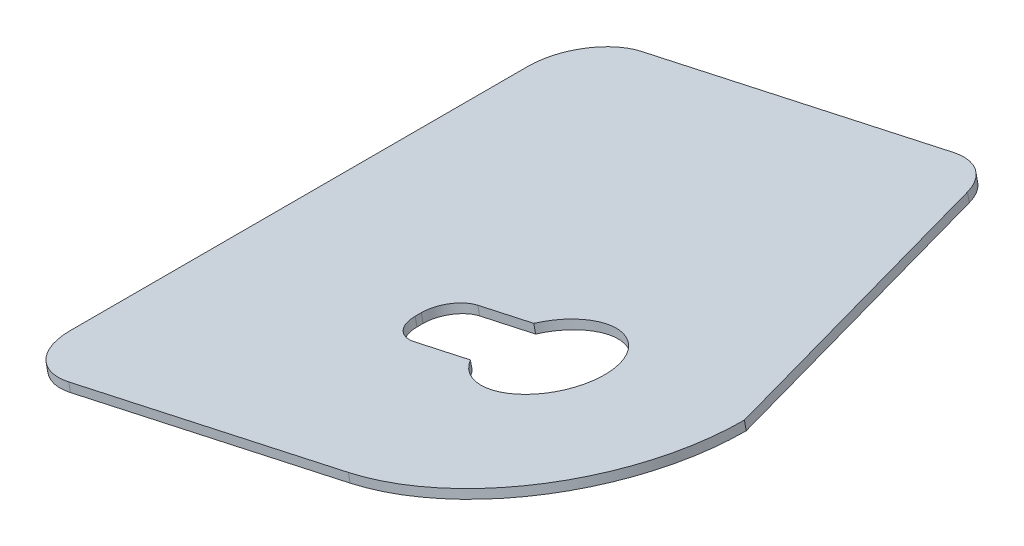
ISO-10303-21;
HEADER;
FILE_DESCRIPTION(('STEP AP214'),'2;1');
FILE_NAME('part.step','',(''),(''),'','','');
FILE_SCHEMA(('AUTOMOTIVE_DESIGN { 1 0 10303 214 1 1 1 1 }'));
ENDSEC;
DATA;
#1=APPLICATION_CONTEXT('core data for automotive mechanical design processes');
#2=APPLICATION_PROTOCOL_DEFINITION('international standard','automotive_design',2000,#1);
#3=PRODUCT_CONTEXT('',#1,'mechanical');
#4=PRODUCT('Part','Part','',(#3));
#5=PRODUCT_RELATED_PRODUCT_CATEGORY('part','',(#4));
#6=PRODUCT_DEFINITION_FORMATION('','',#4);
#7=PRODUCT_DEFINITION_CONTEXT('part definition',#1,'design');
#8=PRODUCT_DEFINITION('design','',#6,#7);
#9=PRODUCT_DEFINITION_SHAPE('','',#8);
#10=(LENGTH_UNIT() NAMED_UNIT(*) SI_UNIT(.MILLI.,.METRE.));
#11=(NAMED_UNIT(*) PLANE_ANGLE_UNIT() SI_UNIT($,.RADIAN.));
#12=(NAMED_UNIT(*) SI_UNIT($,.STERADIAN.) SOLID_ANGLE_UNIT());
#13=UNCERTAINTY_MEASURE_WITH_UNIT(LENGTH_MEASURE(1.E-05),#10,'distance_accuracy_value','');
#14=(GEOMETRIC_REPRESENTATION_CONTEXT(3) GLOBAL_UNCERTAINTY_ASSIGNED_CONTEXT((#13)) GLOBAL_UNIT_ASSIGNED_CONTEXT((#10,
#11,#12)) REPRESENTATION_CONTEXT('',''));
#15=CARTESIAN_POINT('',(0.,0.,0.));
#16=DIRECTION('',(0.,0.,1.));
#17=DIRECTION('',(1.,0.,0.));
#18=AXIS2_PLACEMENT_3D('',#15,#16,#17);
#19=CARTESIAN_POINT('',(-15.18533166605,-0.6930586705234,68.5));
#20=DIRECTION('',(0.214527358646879,-0.976717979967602,0.));
#21=DIRECTION('',(0.976717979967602,0.214527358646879,0.));
#22=AXIS2_PLACEMENT_3D('',#19,#20,#21);
#23=PLANE('',#22);
#24=DIRECTION('',(-0.976717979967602,-0.214527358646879,0.));
#25=VECTOR('',#24,1.);
#26=CARTESIAN_POINT('',(-10.3603448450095,0.3667064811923,74.6467013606));
#27=LINE('',#26,#25);
#28=CARTESIAN_POINT('',(-10.9297547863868,0.241640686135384,74.6467013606));
#29=VERTEX_POINT('',#28);
#30=CARTESIAN_POINT('',(-9.95303680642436,0.456168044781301,74.6467013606));
#31=VERTEX_POINT('',#30);
#32=EDGE_CURVE('E122',#29,#31,#27,.F.);
#33=ORIENTED_EDGE('',*,*,#32,.F.);
#34=CARTESIAN_POINT('',(-10.9297547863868,0.241640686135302,75.1467013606));
#35=DIRECTION('',(-0.214527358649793,0.976717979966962,0.));
#36=DIRECTION('',(-0.976717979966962,-0.214527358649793,0.));
#37=AXIS2_PLACEMENT_3D('',#34,#35,#36);
#38=CIRCLE('',#37,0.5);
#39=CARTESIAN_POINT('',(-11.4181137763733,0.134377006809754,75.1467013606));
#40=VERTEX_POINT('',#39);
#41=EDGE_CURVE('E23',#40,#29,#38,.F.);
#42=ORIENTED_EDGE('',*,*,#41,.F.);
#43=DIRECTION('',(0.,0.,1.));
#44=VECTOR('',#43,1.);
#45=CARTESIAN_POINT('',(-11.4181137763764,0.134377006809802,75.2));
#46=LINE('',#45,#44);
#47=CARTESIAN_POINT('',(-11.4181137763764,0.134377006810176,75.2532986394));
#48=VERTEX_POINT('',#47);
#49=EDGE_CURVE('E119',#40,#48,#46,.T.);
#50=ORIENTED_EDGE('',*,*,#49,.T.);
#51=CARTESIAN_POINT('',(-10.9297547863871,0.241640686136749,75.2532986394));
#52=DIRECTION('',(-0.214527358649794,0.976717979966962,0.));
#53=DIRECTION('',(-0.976717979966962,-0.214527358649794,0.));
#54=AXIS2_PLACEMENT_3D('',#51,#52,#53);
#55=CIRCLE('',#54,0.500000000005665);
#56=CARTESIAN_POINT('',(-10.9297547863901,0.241640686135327,75.7532986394));
#57=VERTEX_POINT('',#56);
#58=EDGE_CURVE('E154',#48,#57,#55,.T.);
#59=ORIENTED_EDGE('',*,*,#58,.T.);
#60=DIRECTION('',(0.976717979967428,0.21452735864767,0.));
#61=VECTOR('',#60,1.);
#62=CARTESIAN_POINT('',(-10.4413957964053,0.348904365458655,75.7532986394));
#63=LINE('',#62,#61);
#64=CARTESIAN_POINT('',(-9.95303680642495,0.456168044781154,75.7532986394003));
#65=VERTEX_POINT('',#64);
#66=EDGE_CURVE('E150',#57,#65,#63,.T.);
#67=ORIENTED_EDGE('',*,*,#66,.T.);
#68=CARTESIAN_POINT('',(-9.13944737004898,0.634865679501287,75.2));
#69=DIRECTION('',(0.214527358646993,-0.976717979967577,0.));
#70=DIRECTION('',(0.976717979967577,0.214527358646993,0.));
#71=AXIS2_PLACEMENT_3D('',#68,#69,#70);
#72=CIRCLE('',#71,0.999999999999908);
#73=EDGE_CURVE('E146',#65,#31,#72,.F.);
#74=ORIENTED_EDGE('',*,*,#73,.T.);
#75=EDGE_LOOP('',(#33,#42,#50,#59,#67,#74));
#76=FACE_BOUND('',#75,.T.);
#77=CARTESIAN_POINT('',(-8.57027854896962,0.759878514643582,69.7));
#78=DIRECTION('',(-0.214527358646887,0.976717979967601,0.));
#79=DIRECTION('',(-0.9767179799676,-0.214527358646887,0.));
#80=AXIS2_PLACEMENT_3D('',#77,#78,#79);
#81=CIRCLE('',#80,1.00000000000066);
#82=CARTESIAN_POINT('',(-8.57027854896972,0.759878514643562,68.6999999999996));
#83=VERTEX_POINT('',#82);
#84=CARTESIAN_POINT('',(-7.64511568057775,0.963082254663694,69.3794038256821));
#85=VERTEX_POINT('',#84);
#86=EDGE_CURVE('E178',#83,#85,#81,.F.);
#87=ORIENTED_EDGE('',*,*,#86,.T.);
#88=DIRECTION('',(-0.313132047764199,-0.0687766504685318,-0.947215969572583));
#89=VECTOR('',#88,1.);
#90=CARTESIAN_POINT('',(-6.68302506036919,1.17439684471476,72.289701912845));
#91=LINE('',#90,#89);
#92=CARTESIAN_POINT('',(-5.72093444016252,1.38571143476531,75.2000000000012));
#93=VERTEX_POINT('',#92);
#94=EDGE_CURVE('E174',#85,#93,#91,.F.);
#95=ORIENTED_EDGE('',*,*,#94,.T.);
#96=CARTESIAN_POINT('',(-9.13944737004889,0.634865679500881,75.2));
#97=DIRECTION('',(0.214527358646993,-0.976717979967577,0.));
#98=DIRECTION('',(0.976717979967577,0.214527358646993,0.));
#99=AXIS2_PLACEMENT_3D('',#96,#97,#98);
#100=CIRCLE('',#99,3.49999999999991);
#101=CARTESIAN_POINT('',(-9.13944737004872,0.634865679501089,78.7));
#102=VERTEX_POINT('',#101);
#103=EDGE_CURVE('E170',#93,#102,#100,.T.);
#104=ORIENTED_EDGE('',*,*,#103,.T.);
#105=DIRECTION('',(0.976717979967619,0.214527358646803,0.));
#106=VECTOR('',#105,1.);
#107=CARTESIAN_POINT('',(-11.5812423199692,0.0985472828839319,78.7));
#108=LINE('',#107,#106);
#109=CARTESIAN_POINT('',(-14.0230372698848,-0.437771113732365,78.7000000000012));
#110=VERTEX_POINT('',#109);
#111=EDGE_CURVE('E166',#102,#110,#108,.F.);
#112=ORIENTED_EDGE('',*,*,#111,.T.);
#113=CARTESIAN_POINT('',(-14.0230372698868,-0.437771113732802,77.7));
#114=DIRECTION('',(-0.214527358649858,0.976717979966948,0.));
#115=DIRECTION('',(-0.976717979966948,-0.214527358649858,0.));
#116=AXIS2_PLACEMENT_3D('',#113,#114,#115);
#117=CIRCLE('',#116,1.00000000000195);
#118=CARTESIAN_POINT('',(-14.9997552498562,-0.652298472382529,77.7));
#119=VERTEX_POINT('',#118);
#120=EDGE_CURVE('E162',#110,#119,#117,.F.);
#121=ORIENTED_EDGE('',*,*,#120,.T.);
#122=DIRECTION('',(0.,0.,1.));
#123=VECTOR('',#122,1.);
#124=CARTESIAN_POINT('',(-14.9997552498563,-0.652298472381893,73.7));
#125=LINE('',#124,#123);
#126=CARTESIAN_POINT('',(-14.9997552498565,-0.652298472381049,69.7));
#127=VERTEX_POINT('',#126);
#128=EDGE_CURVE('E131',#119,#127,#125,.F.);
#129=ORIENTED_EDGE('',*,*,#128,.T.);
#130=CARTESIAN_POINT('',(-14.0230372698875,-0.437771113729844,69.7));
#131=DIRECTION('',(-0.214527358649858,0.976717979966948,0.));
#132=DIRECTION('',(-0.976717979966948,-0.214527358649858,0.));
#133=AXIS2_PLACEMENT_3D('',#130,#131,#132);
#134=CIRCLE('',#133,0.999999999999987);
#135=CARTESIAN_POINT('',(-14.0230372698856,-0.437771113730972,68.7));
#136=VERTEX_POINT('',#135);
#137=EDGE_CURVE('E185',#127,#136,#134,.F.);
#138=ORIENTED_EDGE('',*,*,#137,.T.);
#139=DIRECTION('',(-0.976717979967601,-0.214527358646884,0.));
#140=VECTOR('',#139,1.);
#141=CARTESIAN_POINT('',(-11.2966579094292,0.161053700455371,68.7));
#142=LINE('',#141,#140);
#143=EDGE_CURVE('E182',#136,#83,#142,.F.);
#144=ORIENTED_EDGE('',*,*,#143,.T.);
#145=EDGE_LOOP('',(#87,#95,#104,#112,#121,#129,#138,#144));
#146=FACE_BOUND('',#145,.T.);
#147=ADVANCED_FACE('F19',(#76,#146),#23,.T.);
#148=CARTESIAN_POINT('',(-14.0230372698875,-0.437771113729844,69.7));
#149=DIRECTION('',(-0.214527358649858,0.976717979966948,0.));
#150=DIRECTION('',(-0.976717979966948,-0.214527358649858,0.));
#151=AXIS2_PLACEMENT_3D('',#148,#149,#150);
#152=CYLINDRICAL_SURFACE('',#151,0.999999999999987);
#153=ORIENTED_EDGE('',*,*,#137,.F.);
#154=DIRECTION('',(0.214527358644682,-0.976717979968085,0.));
#155=VECTOR('',#154,1.);
#156=CARTESIAN_POINT('',(-15.015844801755,-0.5790446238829,69.7));
#157=LINE('',#156,#155);
#158=CARTESIAN_POINT('',(-15.0319343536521,-0.505790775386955,69.7));
#159=VERTEX_POINT('',#158);
#160=EDGE_CURVE('E159',#127,#159,#157,.F.);
#161=ORIENTED_EDGE('',*,*,#160,.T.);
#162=CARTESIAN_POINT('',(-14.055216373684,-0.291263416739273,69.7));
#163=DIRECTION('',(-0.214527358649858,0.976717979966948,0.));
#164=DIRECTION('',(-0.976717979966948,-0.214527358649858,0.));
#165=AXIS2_PLACEMENT_3D('',#162,#163,#164);
#166=CIRCLE('',#165,0.999999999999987);
#167=CARTESIAN_POINT('',(-14.0552163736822,-0.291263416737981,68.7));
#168=VERTEX_POINT('',#167);
#169=EDGE_CURVE('E134',#159,#168,#166,.F.);
#170=ORIENTED_EDGE('',*,*,#169,.T.);
#171=DIRECTION('',(-0.21452735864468,0.976717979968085,0.));
#172=VECTOR('',#171,1.);
#173=CARTESIAN_POINT('',(-14.0391268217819,-0.364517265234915,68.7));
#174=LINE('',#173,#172);
#175=EDGE_CURVE('E183',#168,#136,#174,.F.);
#176=ORIENTED_EDGE('',*,*,#175,.T.);
#177=EDGE_LOOP('',(#153,#161,#170,#176));
#178=FACE_BOUND('',#177,.T.);
#179=ADVANCED_FACE('F229',(#178),#152,.T.);
#180=CARTESIAN_POINT('',(-14.1678225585,-0.2990490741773,68.7));
#181=DIRECTION('',(0.,0.,-1.));
#182=DIRECTION('',(0.976717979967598,0.214527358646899,0.));
#183=AXIS2_PLACEMENT_3D('',#180,#181,#182);
#184=PLANE('',#183);
#185=DIRECTION('',(0.214527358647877,-0.976717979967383,-2.80427589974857E-12));
#186=VECTOR('',#185,1.);
#187=CARTESIAN_POINT('',(-8.58636810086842,0.833132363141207,68.6999999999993));
#188=LINE('',#187,#186);
#189=CARTESIAN_POINT('',(-8.60245765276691,0.906386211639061,68.6999999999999));
#190=VERTEX_POINT('',#189);
#191=EDGE_CURVE('E179',#190,#83,#188,.T.);
#192=ORIENTED_EDGE('',*,*,#191,.T.);
#193=ORIENTED_EDGE('',*,*,#143,.F.);
#194=ORIENTED_EDGE('',*,*,#175,.F.);
#195=DIRECTION('',(0.976717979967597,0.214527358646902,0.));
#196=VECTOR('',#195,1.);
#197=CARTESIAN_POINT('',(-10.392523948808,0.51321417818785,68.7));
#198=LINE('',#197,#196);
#199=EDGE_CURVE('E137',#168,#190,#198,.T.);
#200=ORIENTED_EDGE('',*,*,#199,.T.);
#201=EDGE_LOOP('',(#192,#193,#194,#200));
#202=FACE_BOUND('',#201,.T.);
#203=ADVANCED_FACE('F226',(#202),#184,.T.);
#204=CARTESIAN_POINT('',(-8.57027854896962,0.759878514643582,69.7));
#205=DIRECTION('',(-0.214527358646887,0.976717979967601,0.));
#206=DIRECTION('',(-0.9767179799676,-0.214527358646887,0.));
#207=AXIS2_PLACEMENT_3D('',#204,#205,#206);
#208=CYLINDRICAL_SURFACE('',#207,1.00000000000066);
#209=ORIENTED_EDGE('',*,*,#86,.F.);
#210=ORIENTED_EDGE('',*,*,#191,.F.);
#211=CARTESIAN_POINT('',(-8.60245765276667,0.906386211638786,69.7));
#212=DIRECTION('',(-0.214527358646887,0.976717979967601,0.));
#213=DIRECTION('',(-0.9767179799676,-0.214527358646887,0.));
#214=AXIS2_PLACEMENT_3D('',#211,#212,#213);
#215=CIRCLE('',#214,1.00000000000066);
#216=CARTESIAN_POINT('',(-7.67729478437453,1.10958995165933,69.3794038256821));
#217=VERTEX_POINT('',#216);
#218=EDGE_CURVE('E213',#190,#217,#215,.F.);
#219=ORIENTED_EDGE('',*,*,#218,.T.);
#220=DIRECTION('',(-0.214527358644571,0.976717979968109,0.));
#221=VECTOR('',#220,1.);
#222=CARTESIAN_POINT('',(-7.66120523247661,1.03633610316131,69.3794038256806));
#223=LINE('',#222,#221);
#224=EDGE_CURVE('E175',#217,#85,#223,.F.);
#225=ORIENTED_EDGE('',*,*,#224,.T.);
#226=EDGE_LOOP('',(#209,#210,#219,#225));
#227=FACE_BOUND('',#226,.T.);
#228=ADVANCED_FACE('F238',(#227),#208,.T.);
#229=CARTESIAN_POINT('',(-7.719329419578,1.117304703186,69.2629919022));
#230=DIRECTION('',(0.925162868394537,0.203203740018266,-0.32059617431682));
#231=DIRECTION('',(0.313132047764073,0.0687766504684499,0.947215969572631));
#232=AXIS2_PLACEMENT_3D('',#229,#230,#231);
#233=PLANE('',#232);
#234=DIRECTION('',(0.21452735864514,-0.976717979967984,0.));
#235=VECTOR('',#234,1.);
#236=CARTESIAN_POINT('',(-5.737023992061,1.458965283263,75.2));
#237=LINE('',#236,#235);
#238=CARTESIAN_POINT('',(-5.75311354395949,1.53221913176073,75.200000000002));
#239=VERTEX_POINT('',#238);
#240=EDGE_CURVE('E171',#239,#93,#237,.T.);
#241=ORIENTED_EDGE('',*,*,#240,.T.);
#242=ORIENTED_EDGE('',*,*,#94,.F.);
#243=ORIENTED_EDGE('',*,*,#224,.F.);
#244=DIRECTION('',(0.313132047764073,0.0687766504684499,0.947215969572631));
#245=VECTOR('',#244,1.);
#246=CARTESIAN_POINT('',(-7.71577840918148,1.101137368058,69.2629919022));
#247=LINE('',#246,#245);
#248=EDGE_CURVE('E210',#217,#239,#247,.T.);
#249=ORIENTED_EDGE('',*,*,#248,.T.);
#250=EDGE_LOOP('',(#241,#242,#243,#249));
#251=FACE_BOUND('',#250,.T.);
#252=ADVANCED_FACE('F242',(#251),#233,.T.);
#253=CARTESIAN_POINT('',(-9.171626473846,0.7813733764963,75.2));
#254=DIRECTION('',(0.214527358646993,-0.976717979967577,0.));
#255=DIRECTION('',(0.976717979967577,0.214527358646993,0.));
#256=AXIS2_PLACEMENT_3D('',#253,#254,#255);
#257=CYLINDRICAL_SURFACE('',#256,3.49999999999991);
#258=ORIENTED_EDGE('',*,*,#103,.F.);
#259=ORIENTED_EDGE('',*,*,#240,.F.);
#260=CARTESIAN_POINT('',(-9.171626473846,0.7813733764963,75.2));
#261=DIRECTION('',(0.214527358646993,-0.976717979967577,0.));
#262=DIRECTION('',(0.976717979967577,0.214527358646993,0.));
#263=AXIS2_PLACEMENT_3D('',#260,#261,#262);
#264=CIRCLE('',#263,3.49999999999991);
#265=CARTESIAN_POINT('',(-9.17162647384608,0.781373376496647,78.7));
#266=VERTEX_POINT('',#265);
#267=EDGE_CURVE('E207',#239,#266,#264,.T.);
#268=ORIENTED_EDGE('',*,*,#267,.T.);
#269=DIRECTION('',(-0.214527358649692,0.976717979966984,0.));
#270=VECTOR('',#269,1.);
#271=CARTESIAN_POINT('',(-9.15553692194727,0.708119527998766,78.7));
#272=LINE('',#271,#270);
#273=EDGE_CURVE('E167',#266,#102,#272,.F.);
#274=ORIENTED_EDGE('',*,*,#273,.T.);
#275=EDGE_LOOP('',(#258,#259,#268,#274));
#276=FACE_BOUND('',#275,.T.);
#277=ADVANCED_FACE('F244',(#276),#257,.T.);
#278=CARTESIAN_POINT('',(-9.077505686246,0.8189934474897,78.7));
#279=DIRECTION('',(0.,0.,1.));
#280=DIRECTION('',(-0.976717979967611,-0.21452735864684,0.));
#281=AXIS2_PLACEMENT_3D('',#278,#279,#280);
#282=PLANE('',#281);
#283=ORIENTED_EDGE('',*,*,#273,.F.);
#284=DIRECTION('',(-0.976717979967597,-0.214527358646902,0.));
#285=VECTOR('',#284,1.);
#286=CARTESIAN_POINT('',(-10.392523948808,0.51321417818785,78.7));
#287=LINE('',#286,#285);
#288=CARTESIAN_POINT('',(-14.0552163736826,-0.291263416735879,78.7000000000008));
#289=VERTEX_POINT('',#288);
#290=EDGE_CURVE('E206',#266,#289,#287,.T.);
#291=ORIENTED_EDGE('',*,*,#290,.T.);
#292=DIRECTION('',(0.214527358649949,-0.976717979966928,5.30538683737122E-12));
#293=VECTOR('',#292,1.);
#294=CARTESIAN_POINT('',(-14.0391268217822,-0.364517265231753,78.700000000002));
#295=LINE('',#294,#293);
#296=EDGE_CURVE('E163',#289,#110,#295,.T.);
#297=ORIENTED_EDGE('',*,*,#296,.T.);
#298=ORIENTED_EDGE('',*,*,#111,.F.);
#299=EDGE_LOOP('',(#283,#291,#297,#298));
#300=FACE_BOUND('',#299,.T.);
#301=ADVANCED_FACE('F352',(#300),#282,.T.);
#302=CARTESIAN_POINT('',(-14.0230372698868,-0.437771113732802,77.7));
#303=DIRECTION('',(-0.214527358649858,0.976717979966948,0.));
#304=DIRECTION('',(-0.976717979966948,-0.214527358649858,0.));
#305=AXIS2_PLACEMENT_3D('',#302,#303,#304);
#306=CYLINDRICAL_SURFACE('',#305,1.00000000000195);
#307=ORIENTED_EDGE('',*,*,#120,.F.);
#308=ORIENTED_EDGE('',*,*,#296,.F.);
#309=CARTESIAN_POINT('',(-14.0552163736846,-0.291263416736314,77.7));
#310=DIRECTION('',(-0.214527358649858,0.976717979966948,0.));
#311=DIRECTION('',(-0.976717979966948,-0.214527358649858,0.));
#312=AXIS2_PLACEMENT_3D('',#309,#310,#311);
#313=CIRCLE('',#312,1.00000000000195);
#314=CARTESIAN_POINT('',(-15.0319343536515,-0.505790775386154,77.7));
#315=VERTEX_POINT('',#314);
#316=EDGE_CURVE('E202',#289,#315,#313,.F.);
#317=ORIENTED_EDGE('',*,*,#316,.T.);
#318=DIRECTION('',(-0.214527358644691,0.976717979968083,0.));
#319=VECTOR('',#318,1.);
#320=CARTESIAN_POINT('',(-15.015844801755,-0.5790446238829,77.7));
#321=LINE('',#320,#319);
#322=EDGE_CURVE('E156',#315,#119,#321,.F.);
#323=ORIENTED_EDGE('',*,*,#322,.T.);
#324=EDGE_LOOP('',(#307,#308,#317,#323));
#325=FACE_BOUND('',#324,.T.);
#326=ADVANCED_FACE('F343',(#325),#306,.T.);
#327=CARTESIAN_POINT('',(-15.03548536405,-0.4896234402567,77.86));
#328=DIRECTION('',(-0.976717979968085,-0.214527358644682,0.));
#329=DIRECTION('',(0.,0.,-1.));
#330=AXIS2_PLACEMENT_3D('',#327,#328,#329);
#331=PLANE('',#330);
#332=ORIENTED_EDGE('',*,*,#322,.F.);
#333=DIRECTION('',(0.,0.,-1.));
#334=VECTOR('',#333,1.);
#335=CARTESIAN_POINT('',(-15.0319343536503,-0.505790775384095,73.7));
#336=LINE('',#335,#334);
#337=EDGE_CURVE('E205',#315,#159,#336,.T.);
#338=ORIENTED_EDGE('',*,*,#337,.T.);
#339=ORIENTED_EDGE('',*,*,#160,.F.);
#340=ORIENTED_EDGE('',*,*,#128,.F.);
#341=EDGE_LOOP('',(#332,#338,#339,#340));
#342=FACE_BOUND('',#341,.T.);
#343=ADVANCED_FACE('F277',(#342),#331,.T.);
#344=CARTESIAN_POINT('',(-11.45384389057,0.297052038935,75.26985135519));
#345=DIRECTION('',(-0.976717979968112,-0.214527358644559,0.));
#346=DIRECTION('',(0.,0.,-1.));
#347=AXIS2_PLACEMENT_3D('',#344,#345,#346);
#348=PLANE('',#347);
#349=DIRECTION('',(-0.214527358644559,0.976717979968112,0.));
#350=VECTOR('',#349,1.);
#351=CARTESIAN_POINT('',(-11.434203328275,0.20763085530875,75.2532986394));
#352=LINE('',#351,#350);
#353=CARTESIAN_POINT('',(-11.4502928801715,0.280884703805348,75.2532986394));
#354=VERTEX_POINT('',#353);
#355=EDGE_CURVE('E130',#354,#48,#352,.F.);
#356=ORIENTED_EDGE('',*,*,#355,.T.);
#357=ORIENTED_EDGE('',*,*,#49,.F.);
#358=DIRECTION('',(0.214527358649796,-0.976717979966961,5.22959559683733E-12));
#359=VECTOR('',#358,1.);
#360=CARTESIAN_POINT('',(-11.4342033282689,0.207630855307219,75.1467013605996));
#361=LINE('',#360,#359);
#362=CARTESIAN_POINT('',(-11.4502928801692,0.280884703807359,75.1467013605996));
#363=VERTEX_POINT('',#362);
#364=EDGE_CURVE('E129',#40,#363,#361,.F.);
#365=ORIENTED_EDGE('',*,*,#364,.T.);
#366=DIRECTION('',(0.,0.,1.));
#367=VECTOR('',#366,1.);
#368=CARTESIAN_POINT('',(-11.4502928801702,0.280884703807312,73.7));
#369=LINE('',#368,#367);
#370=EDGE_CURVE('E201',#363,#354,#369,.T.);
#371=ORIENTED_EDGE('',*,*,#370,.T.);
#372=EDGE_LOOP('',(#356,#357,#365,#371));
#373=FACE_BOUND('',#372,.T.);
#374=ADVANCED_FACE('F127',(#373),#348,.F.);
#375=CARTESIAN_POINT('',(-10.9297547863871,0.241640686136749,75.2532986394));
#376=DIRECTION('',(-0.214527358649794,0.976717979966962,0.));
#377=DIRECTION('',(-0.976717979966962,-0.214527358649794,0.));
#378=AXIS2_PLACEMENT_3D('',#375,#376,#377);
#379=CYLINDRICAL_SURFACE('',#378,0.500000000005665);
#380=DIRECTION('',(0.214527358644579,-0.976717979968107,0.));
#381=VECTOR('',#380,1.);
#382=CARTESIAN_POINT('',(-10.9458443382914,0.314894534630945,75.7532986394));
#383=LINE('',#382,#381);
#384=CARTESIAN_POINT('',(-10.9619338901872,0.388148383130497,75.7532986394));
#385=VERTEX_POINT('',#384);
#386=EDGE_CURVE('E151',#385,#57,#383,.T.);
#387=ORIENTED_EDGE('',*,*,#386,.T.);
#388=ORIENTED_EDGE('',*,*,#58,.F.);
#389=ORIENTED_EDGE('',*,*,#355,.F.);
#390=CARTESIAN_POINT('',(-10.9619338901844,0.388148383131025,75.2532986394));
#391=DIRECTION('',(-0.214527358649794,0.976717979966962,0.));
#392=DIRECTION('',(-0.976717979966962,-0.214527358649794,0.));
#393=AXIS2_PLACEMENT_3D('',#390,#391,#392);
#394=CIRCLE('',#393,0.500000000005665);
#395=EDGE_CURVE('E198',#354,#385,#394,.T.);
#396=ORIENTED_EDGE('',*,*,#395,.T.);
#397=EDGE_LOOP('',(#387,#388,#389,#396));
#398=FACE_BOUND('',#397,.T.);
#399=ADVANCED_FACE('F268',(#398),#379,.F.);
#400=CARTESIAN_POINT('',(-9.969232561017,0.6231336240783,75.7532986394));
#401=DIRECTION('',(0.,0.,1.));
#402=DIRECTION('',(-0.976717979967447,-0.214527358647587,0.));
#403=AXIS2_PLACEMENT_3D('',#400,#401,#402);
#404=PLANE('',#403);
#405=DIRECTION('',(-0.214527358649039,0.976717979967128,1.28845108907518E-12));
#406=VECTOR('',#405,1.);
#407=CARTESIAN_POINT('',(-9.96912635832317,0.529421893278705,75.7532986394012));
#408=LINE('',#407,#406);
#409=CARTESIAN_POINT('',(-9.98521591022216,0.602675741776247,75.7532986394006));
#410=VERTEX_POINT('',#409);
#411=EDGE_CURVE('E147',#410,#65,#408,.F.);
#412=ORIENTED_EDGE('',*,*,#411,.T.);
#413=ORIENTED_EDGE('',*,*,#66,.F.);
#414=ORIENTED_EDGE('',*,*,#386,.F.);
#415=DIRECTION('',(0.976717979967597,0.214527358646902,0.));
#416=VECTOR('',#415,1.);
#417=CARTESIAN_POINT('',(-10.392523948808,0.51321417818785,75.7532986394));
#418=LINE('',#417,#416);
#419=EDGE_CURVE('E197',#385,#410,#418,.T.);
#420=ORIENTED_EDGE('',*,*,#419,.T.);
#421=EDGE_LOOP('',(#412,#413,#414,#420));
#422=FACE_BOUND('',#421,.T.);
#423=ADVANCED_FACE('F265',(#422),#404,.F.);
#424=CARTESIAN_POINT('',(-9.17162647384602,0.781373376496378,75.2));
#425=DIRECTION('',(0.214527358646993,-0.976717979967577,0.));
#426=DIRECTION('',(0.976717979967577,0.214527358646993,0.));
#427=AXIS2_PLACEMENT_3D('',#424,#425,#426);
#428=CYLINDRICAL_SURFACE('',#427,0.999999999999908);
#429=ORIENTED_EDGE('',*,*,#73,.F.);
#430=ORIENTED_EDGE('',*,*,#411,.F.);
#431=CARTESIAN_POINT('',(-9.17162647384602,0.781373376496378,75.2));
#432=DIRECTION('',(0.214527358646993,-0.976717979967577,0.));
#433=DIRECTION('',(0.976717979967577,0.214527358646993,0.));
#434=AXIS2_PLACEMENT_3D('',#431,#432,#433);
#435=CIRCLE('',#434,0.999999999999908);
#436=CARTESIAN_POINT('',(-9.98521591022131,0.602675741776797,74.6467013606));
#437=VERTEX_POINT('',#436);
#438=EDGE_CURVE('E194',#410,#437,#435,.F.);
#439=ORIENTED_EDGE('',*,*,#438,.T.);
#440=DIRECTION('',(0.21452735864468,-0.976717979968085,0.));
#441=VECTOR('',#440,1.);
#442=CARTESIAN_POINT('',(-9.96912635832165,0.529421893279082,74.6467013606));
#443=LINE('',#442,#441);
#444=EDGE_CURVE('E139',#437,#31,#443,.T.);
#445=ORIENTED_EDGE('',*,*,#444,.T.);
#446=EDGE_LOOP('',(#429,#430,#439,#445));
#447=FACE_BOUND('',#446,.T.);
#448=ADVANCED_FACE('F262',(#447),#428,.F.);
#449=CARTESIAN_POINT('',(-10.98501926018,0.4000251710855,74.6467013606));
#450=DIRECTION('',(0.,0.,-1.));
#451=DIRECTION('',(0.976717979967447,0.214527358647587,0.));
#452=AXIS2_PLACEMENT_3D('',#449,#450,#451);
#453=PLANE('',#452);
#454=ORIENTED_EDGE('',*,*,#444,.F.);
#455=DIRECTION('',(-0.976717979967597,-0.214527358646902,0.));
#456=VECTOR('',#455,1.);
#457=CARTESIAN_POINT('',(-10.392523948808,0.51321417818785,74.6467013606));
#458=LINE('',#457,#456);
#459=CARTESIAN_POINT('',(-10.9619338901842,0.388148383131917,74.6467013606));
#460=VERTEX_POINT('',#459);
#461=EDGE_CURVE('E29',#437,#460,#458,.T.);
#462=ORIENTED_EDGE('',*,*,#461,.T.);
#463=DIRECTION('',(-0.2145273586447,0.976717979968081,0.));
#464=VECTOR('',#463,1.);
#465=CARTESIAN_POINT('',(-10.945844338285,0.3148945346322,74.6467013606));
#466=LINE('',#465,#464);
#467=EDGE_CURVE('E37',#460,#29,#466,.F.);
#468=ORIENTED_EDGE('',*,*,#467,.T.);
#469=ORIENTED_EDGE('',*,*,#32,.T.);
#470=EDGE_LOOP('',(#454,#462,#468,#469));
#471=FACE_BOUND('',#470,.T.);
#472=ADVANCED_FACE('F256',(#471),#453,.F.);
#473=CARTESIAN_POINT('',(-10.9297547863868,0.241640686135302,75.1467013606));
#474=DIRECTION('',(-0.214527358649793,0.976717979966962,0.));
#475=DIRECTION('',(-0.976717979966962,-0.214527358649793,0.));
#476=AXIS2_PLACEMENT_3D('',#473,#474,#475);
#477=CYLINDRICAL_SURFACE('',#476,0.5);
#478=ORIENTED_EDGE('',*,*,#364,.F.);
#479=ORIENTED_EDGE('',*,*,#41,.T.);
#480=ORIENTED_EDGE('',*,*,#467,.F.);
#481=CARTESIAN_POINT('',(-10.9619338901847,0.388148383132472,75.1467013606));
#482=DIRECTION('',(-0.214527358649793,0.976717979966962,0.));
#483=DIRECTION('',(-0.976717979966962,-0.214527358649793,0.));
#484=AXIS2_PLACEMENT_3D('',#481,#482,#483);
#485=CIRCLE('',#484,0.5);
#486=EDGE_CURVE('E11',#460,#363,#485,.T.);
#487=ORIENTED_EDGE('',*,*,#486,.T.);
#488=EDGE_LOOP('',(#478,#479,#480,#487));
#489=FACE_BOUND('',#488,.T.);
#490=ADVANCED_FACE('F133',(#489),#477,.F.);
#491=CARTESIAN_POINT('',(-15.21751076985,-0.5465509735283,68.5));
#492=DIRECTION('',(0.214527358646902,-0.976717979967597,0.));
#493=DIRECTION('',(0.976717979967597,0.214527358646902,0.));
#494=AXIS2_PLACEMENT_3D('',#491,#492,#493);
#495=PLANE('',#494);
#496=ORIENTED_EDGE('',*,*,#461,.F.);
#497=ORIENTED_EDGE('',*,*,#438,.F.);
#498=ORIENTED_EDGE('',*,*,#419,.F.);
#499=ORIENTED_EDGE('',*,*,#395,.F.);
#500=ORIENTED_EDGE('',*,*,#370,.F.);
#501=ORIENTED_EDGE('',*,*,#486,.F.);
#502=EDGE_LOOP('',(#496,#497,#498,#499,#500,#501));
#503=FACE_BOUND('',#502,.T.);
#504=ORIENTED_EDGE('',*,*,#316,.F.);
#505=ORIENTED_EDGE('',*,*,#290,.F.);
#506=ORIENTED_EDGE('',*,*,#267,.F.);
#507=ORIENTED_EDGE('',*,*,#248,.F.);
#508=ORIENTED_EDGE('',*,*,#218,.F.);
#509=ORIENTED_EDGE('',*,*,#199,.F.);
#510=ORIENTED_EDGE('',*,*,#169,.F.);
#511=ORIENTED_EDGE('',*,*,#337,.F.);
#512=EDGE_LOOP('',(#504,#505,#506,#507,#508,#509,#510,#511));
#513=FACE_BOUND('',#512,.T.);
#514=ADVANCED_FACE('F21',(#503,#513),#495,.F.);
#515=CLOSED_SHELL('',(#147,#179,#203,#228,#252,#277,#301,#326,#343,#374,#399,#423,#448,#472,
#490,#514));
#516=MANIFOLD_SOLID_BREP('B1',#515);
#517=ADVANCED_BREP_SHAPE_REPRESENTATION('',(#18,#516),#14);
#518=SHAPE_DEFINITION_REPRESENTATION(#9,#517);
ENDSEC;
END-ISO-10303-21;
